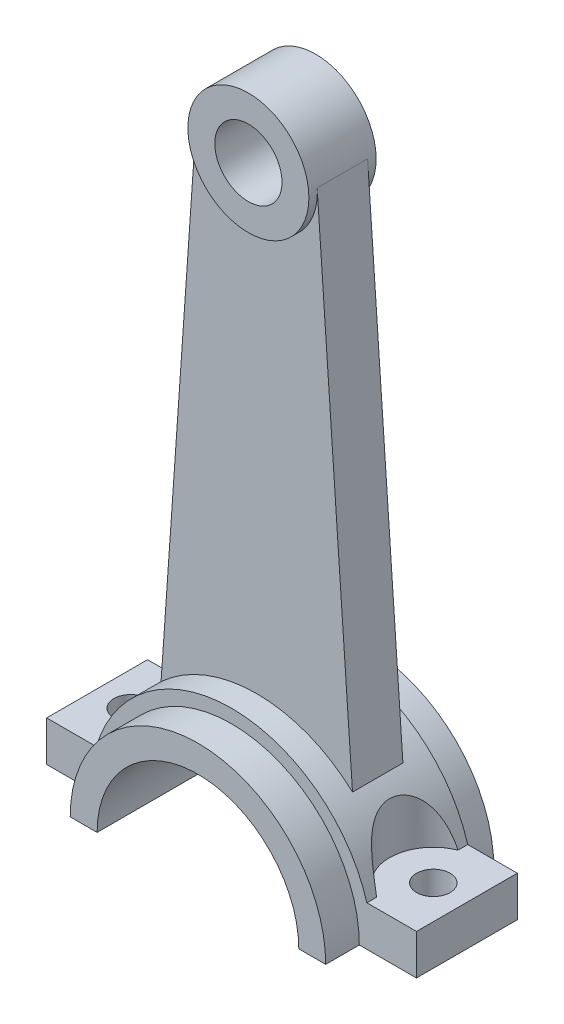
from build123d import *
from build123d.topology import SkipClean

# Parameters (mm, degrees)
SZKIC1_R                    = 18
SZKIC1_R_2                  = 10
DODANIE_WYCI_GNI_CIE1_DEPTH = 10
DODANIE_WYCI_GNI_CIE2_DEPTH = 7.5
DODANIE_WYCI_GNI_CIE3_DEPTH = 15
DODANIE_WYCI_GNI_CIE4_DEPTH = 25
SZKIC2_R                    = 13
WYTNIJ_WYCI_GNI_CIE1_DEPTH  = 196.565845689
SZKIC3_R                    = 5
WYTNIJ_WYCI_GNI_CIE2_DEPTH  = 196.565845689


with BuildPart() as part:
    # Szkic1 → Dodanie-wyci_gni_cie1 (new, symmetric)
    with BuildSketch(Plane.XY):
        with Locations((0, 180)):
            Circle(SZKIC1_R)
        with Locations((0, 180)):
            Circle(SZKIC1_R_2, mode=Mode.SUBTRACT)
    extrude(amount=DODANIE_WYCI_GNI_CIE1_DEPTH, both=True)

    # Szkic1_3 → Dodanie-wyci_gni_cie2 (add, symmetric)
    with SkipClean():  # the faces are left unmerged after this step: merging them gives an invalid solid
        with BuildSketch(Plane.XY):
            with BuildLine():
                ThreePointArc((-28.471679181, 30.87658473), (-15.283707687, 39.120433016), (0, 42))
                Line((0, 42), (0, 162))
                ThreePointArc((0, 162), (-13.164366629, 167.724029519), (-17.956152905, 181.255616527))
                Line((-17.956152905, 181.255616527), (-28.471679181, 30.87658473))
            make_face()
            with BuildLine():
                Line((0, 162), (0, 42))
                ThreePointArc((0, 42), (15.283707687, 39.120433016), (28.471679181, 30.87658473))
                Line((28.471679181, 30.87658473), (17.956152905, 181.255616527))
                ThreePointArc((17.956152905, 181.255616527), (17.989034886, 180.628190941), (18, 180))
                ThreePointArc((18, 180), (12.727922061, 167.272077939), (0, 162))
            make_face()
        extrude(amount=DODANIE_WYCI_GNI_CIE2_DEPTH, both=True)

    # Szkic1_4 → Dodanie-wyci_gni_cie3 (add, symmetric)
    with BuildSketch(Plane.XY):
        with BuildLine():
            Line((0, 42), (0, 38))
            ThreePointArc((0, 38), (26.870057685, 26.870057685), (38, 0))
            Line((38, 0), (55, 0))
            Line((55, 0), (55, 12))
            Line((55, 12), (40.249223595, 12))
            ThreePointArc((40.249223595, 12), (35.633158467, 22.232364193), (28.471679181, 30.87658473))
            ThreePointArc((28.471679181, 30.87658473), (15.283707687, 39.120433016), (0, 42))
        make_face()
        with BuildLine():
            Line((-55, 0), (-38, 0))
            ThreePointArc((-38, 0), (-26.870057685, 26.870057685), (0, 38))
            Line((0, 38), (0, 42))
            ThreePointArc((0, 42), (-15.283707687, 39.120433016), (-28.471679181, 30.87658473))
            ThreePointArc((-28.471679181, 30.87658473), (-35.633158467, 22.232364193), (-40.249223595, 12))
            Line((-40.249223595, 12), (-55, 12))
            Line((-55, 12), (-55, 0))
        make_face()
    extrude(amount=DODANIE_WYCI_GNI_CIE3_DEPTH, both=True)

    # Szkic1_5 → Dodanie-wyci_gni_cie4 (add, symmetric)
    with BuildSketch(Plane.XY):
        with BuildLine():
            Line((-38, 0), (-30, 0))
            ThreePointArc((-30, 0), (-21.213203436, 21.213203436), (0, 30))
            Line((0, 30), (0, 38))
            ThreePointArc((0, 38), (-26.870057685, 26.870057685), (-38, 0))
        make_face()
        with BuildLine():
            Line((0, 38), (0, 30))
            ThreePointArc((0, 30), (21.213203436, 21.213203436), (30, 0))
            Line((30, 0), (38, 0))
            ThreePointArc((38, 0), (26.870057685, 26.870057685), (0, 38))
        make_face()
    extrude(amount=DODANIE_WYCI_GNI_CIE4_DEPTH, both=True)

    # Szkic2 → Wytnij-wyci_gni_cie1 (cut, through all)
    with BuildSketch(Plane(origin=(0, 12, 0), x_dir=(1, 0, 0), z_dir=(0, 1, 0))):
        with Locations((-45, 0)):
            Circle(SZKIC2_R)
    wytnij_wyci_gni_cie1 = extrude(amount=WYTNIJ_WYCI_GNI_CIE1_DEPTH, mode=Mode.SUBTRACT)

    # Szkic3 → Wytnij-wyci_gni_cie2 (cut, through all)
    with BuildSketch(Plane(origin=(0, 12, 0), x_dir=(1, 0, 0), z_dir=(0, 1, 0))):
        with Locations(Location((-45, 0, 0), (0, 0, 270))):
            Circle(SZKIC3_R)
    wytnij_wyci_gni_cie2 = extrude(amount=-WYTNIJ_WYCI_GNI_CIE2_DEPTH, mode=Mode.SUBTRACT)

    # Lustro1: Wytnij-wyci_gni_cie1, Wytnij-wyci_gni_cie2 across plane
    add(wytnij_wyci_gni_cie1.mirror(Plane(origin=(0, 0, 0), x_dir=(0, 0, 1), z_dir=(1, 0, 0))), mode=Mode.SUBTRACT)
    add(wytnij_wyci_gni_cie2.mirror(Plane(origin=(0, 0, 0), x_dir=(0, 0, 1), z_dir=(1, 0, 0))), mode=Mode.SUBTRACT)


solid = part.part
